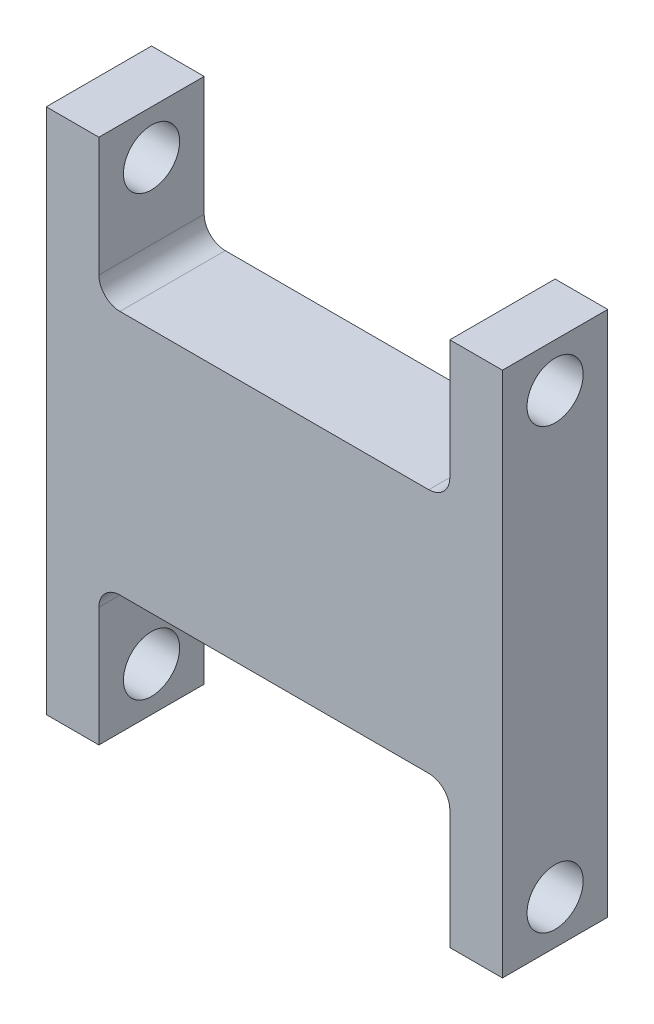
from build123d import *

# Parameters (mm, degrees)
EXTRUSION1_DEPTH             = 15
ENL_V_MAT_EXTRU_1_DEPTH      = 101.374299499
ENL_V_MAT_EXTRU_1_DEPTH_BACK = 101.374299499
ESQUISSE2_R                  = 8


with BuildPart() as part:
    # Esquisse1 → Extrusion1 (new, symmetric)
    with BuildSketch(Plane.XY):
        with BuildLine():
            Line((-44, 35), (44, 35))
            ThreePointArc((44, 35), (48.242640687, 36.757359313), (50, 41))
            Line((50, 41), (50, 75))
            Line((50, 75), (65, 75))
            Line((65, 75), (65, -75))
            Line((65, -75), (50, -75))
            Line((50, -75), (50, -41))
            ThreePointArc((50, -41), (48.242640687, -36.757359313), (44, -35))
            Line((44, -35), (-44, -35))
            ThreePointArc((-44, -35), (-48.242640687, -36.757359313), (-50, -41))
            Line((-50, -41), (-50, -75))
            Line((-50, -75), (-65, -75))
            Line((-65, -75), (-65, 75))
            Line((-65, 75), (-50, 75))
            Line((-50, 75), (-50, 41))
            ThreePointArc((-50, 41), (-48.242640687, 36.757359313), (-44, 35))
        make_face()
    extrude(amount=EXTRUSION1_DEPTH, both=True)

    # Esquisse2 → Enl_v. mat.-Extru.1 (cut, two sides: drawn at the far end of the back side and taken through both)
    with BuildSketch(Plane(origin=(0, 0, 0), x_dir=(0, 0, -1), z_dir=(1, 0, 0)).offset(-ENL_V_MAT_EXTRU_1_DEPTH_BACK)):
        with Locations((0, 62.5)):
            Circle(ESQUISSE2_R)
        with Locations((0, -62.5)):
            Circle(ESQUISSE2_R)
    extrude(amount=ENL_V_MAT_EXTRU_1_DEPTH + ENL_V_MAT_EXTRU_1_DEPTH_BACK, mode=Mode.SUBTRACT)


solid = part.part
